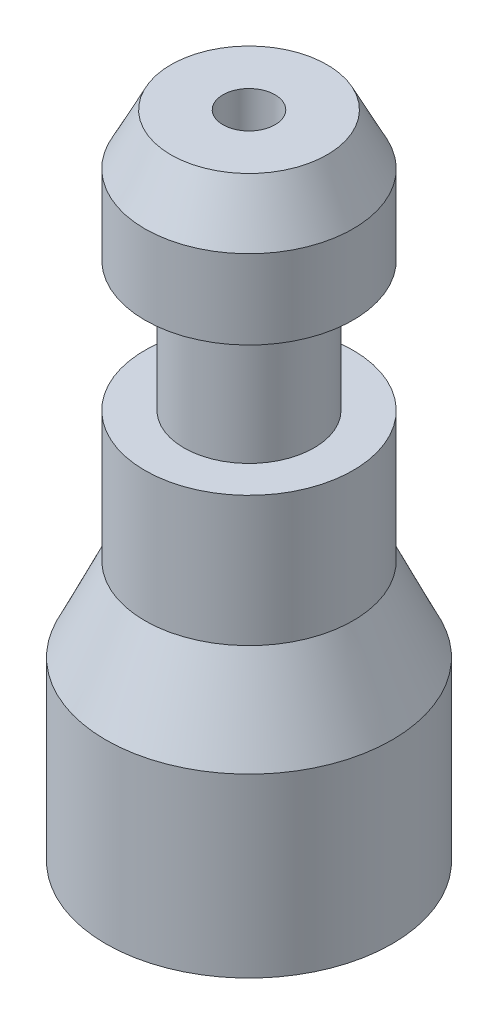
ISO-10303-21;
HEADER;
FILE_DESCRIPTION(('STEP AP214'),'2;1');
FILE_NAME('part.step','',(''),(''),'','','');
FILE_SCHEMA(('AUTOMOTIVE_DESIGN { 1 0 10303 214 1 1 1 1 }'));
ENDSEC;
DATA;
#1=APPLICATION_CONTEXT('core data for automotive mechanical design processes');
#2=APPLICATION_PROTOCOL_DEFINITION('international standard','automotive_design',2000,#1);
#3=PRODUCT_CONTEXT('',#1,'mechanical');
#4=PRODUCT('Part','Part','',(#3));
#5=PRODUCT_RELATED_PRODUCT_CATEGORY('part','',(#4));
#6=PRODUCT_DEFINITION_FORMATION('','',#4);
#7=PRODUCT_DEFINITION_CONTEXT('part definition',#1,'design');
#8=PRODUCT_DEFINITION('design','',#6,#7);
#9=PRODUCT_DEFINITION_SHAPE('','',#8);
#10=(LENGTH_UNIT() NAMED_UNIT(*) SI_UNIT(.MILLI.,.METRE.));
#11=(NAMED_UNIT(*) PLANE_ANGLE_UNIT() SI_UNIT($,.RADIAN.));
#12=(NAMED_UNIT(*) SI_UNIT($,.STERADIAN.) SOLID_ANGLE_UNIT());
#13=UNCERTAINTY_MEASURE_WITH_UNIT(LENGTH_MEASURE(1.E-05),#10,'distance_accuracy_value','');
#14=(GEOMETRIC_REPRESENTATION_CONTEXT(3) GLOBAL_UNCERTAINTY_ASSIGNED_CONTEXT((#13)) GLOBAL_UNIT_ASSIGNED_CONTEXT((#10,
#11,#12)) REPRESENTATION_CONTEXT('',''));
#15=CARTESIAN_POINT('',(0.,0.,0.));
#16=DIRECTION('',(0.,0.,1.));
#17=DIRECTION('',(1.,0.,0.));
#18=AXIS2_PLACEMENT_3D('',#15,#16,#17);
#19=CARTESIAN_POINT('',(0.,0.,0.));
#20=DIRECTION('',(0.,1.,0.));
#21=DIRECTION('',(0.,0.,1.));
#22=AXIS2_PLACEMENT_3D('',#19,#20,#21);
#23=PLANE('',#22);
#24=CARTESIAN_POINT('',(0.,0.,0.));
#25=DIRECTION('',(0.,1.,0.));
#26=DIRECTION('',(0.,0.,1.));
#27=AXIS2_PLACEMENT_3D('',#24,#25,#26);
#28=CIRCLE('',#27,11.);
#29=CARTESIAN_POINT('',(0.,0.,11.));
#30=VERTEX_POINT('',#29);
#31=EDGE_CURVE('E10',#30,#30,#28,.T.);
#32=ORIENTED_EDGE('',*,*,#31,.F.);
#33=EDGE_LOOP('',(#32));
#34=FACE_BOUND('',#33,.T.);
#35=ADVANCED_FACE('F34',(#34),#23,.F.);
#36=CARTESIAN_POINT('',(0.,5.82000000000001,0.));
#37=DIRECTION('',(0.,1.,0.));
#38=DIRECTION('',(0.,0.,1.));
#39=AXIS2_PLACEMENT_3D('',#36,#37,#38);
#40=CYLINDRICAL_SURFACE('',#39,11.);
#41=CARTESIAN_POINT('',(0.,13.57,0.));
#42=DIRECTION('',(0.,1.,0.));
#43=DIRECTION('',(0.,0.,1.));
#44=AXIS2_PLACEMENT_3D('',#41,#42,#43);
#45=CIRCLE('',#44,11.);
#46=CARTESIAN_POINT('',(0.,13.57,11.));
#47=VERTEX_POINT('',#46);
#48=EDGE_CURVE('E40',#47,#47,#45,.T.);
#49=ORIENTED_EDGE('',*,*,#48,.F.);
#50=EDGE_LOOP('',(#49));
#51=FACE_BOUND('',#50,.T.);
#52=ORIENTED_EDGE('',*,*,#31,.T.);
#53=EDGE_LOOP('',(#52));
#54=FACE_BOUND('',#53,.T.);
#55=ADVANCED_FACE('F127',(#51,#54),#40,.T.);
#56=CARTESIAN_POINT('',(0.,13.57,0.));
#57=DIRECTION('',(0.,-1.,0.));
#58=DIRECTION('',(0.,0.,-1.));
#59=AXIS2_PLACEMENT_3D('',#56,#57,#58);
#60=CONICAL_SURFACE('',#59,11.,0.436542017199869);
#61=CARTESIAN_POINT('',(0.,20.,0.));
#62=DIRECTION('',(0.,1.,0.));
#63=DIRECTION('',(0.,0.,1.));
#64=AXIS2_PLACEMENT_3D('',#61,#62,#63);
#65=CIRCLE('',#64,8.);
#66=CARTESIAN_POINT('',(0.,20.,8.));
#67=VERTEX_POINT('',#66);
#68=EDGE_CURVE('E44',#67,#67,#65,.T.);
#69=ORIENTED_EDGE('',*,*,#68,.F.);
#70=EDGE_LOOP('',(#69));
#71=FACE_BOUND('',#70,.T.);
#72=ORIENTED_EDGE('',*,*,#48,.T.);
#73=EDGE_LOOP('',(#72));
#74=FACE_BOUND('',#73,.T.);
#75=ADVANCED_FACE('F122',(#71,#74),#60,.T.);
#76=CARTESIAN_POINT('',(0.,5.82000000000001,0.));
#77=DIRECTION('',(0.,1.,0.));
#78=DIRECTION('',(0.,0.,1.));
#79=AXIS2_PLACEMENT_3D('',#76,#77,#78);
#80=CYLINDRICAL_SURFACE('',#79,8.);
#81=CARTESIAN_POINT('',(0.,30.,0.));
#82=DIRECTION('',(0.,1.,0.));
#83=DIRECTION('',(0.,0.,1.));
#84=AXIS2_PLACEMENT_3D('',#81,#82,#83);
#85=CIRCLE('',#84,8.);
#86=CARTESIAN_POINT('',(0.,30.,8.));
#87=VERTEX_POINT('',#86);
#88=EDGE_CURVE('E48',#87,#87,#85,.T.);
#89=ORIENTED_EDGE('',*,*,#88,.F.);
#90=EDGE_LOOP('',(#89));
#91=FACE_BOUND('',#90,.T.);
#92=ORIENTED_EDGE('',*,*,#68,.T.);
#93=EDGE_LOOP('',(#92));
#94=FACE_BOUND('',#93,.T.);
#95=ADVANCED_FACE('F116',(#91,#94),#80,.T.);
#96=CARTESIAN_POINT('',(0.,30.,-8.));
#97=DIRECTION('',(0.,-1.,0.));
#98=DIRECTION('',(0.,0.,-1.));
#99=AXIS2_PLACEMENT_3D('',#96,#97,#98);
#100=PLANE('',#99);
#101=CARTESIAN_POINT('',(0.,30.,0.));
#102=DIRECTION('',(0.,1.,0.));
#103=DIRECTION('',(0.,0.,1.));
#104=AXIS2_PLACEMENT_3D('',#101,#102,#103);
#105=CIRCLE('',#104,5.);
#106=CARTESIAN_POINT('',(0.,30.,5.));
#107=VERTEX_POINT('',#106);
#108=EDGE_CURVE('E53',#107,#107,#105,.T.);
#109=ORIENTED_EDGE('',*,*,#108,.F.);
#110=EDGE_LOOP('',(#109));
#111=FACE_BOUND('',#110,.T.);
#112=ORIENTED_EDGE('',*,*,#88,.T.);
#113=EDGE_LOOP('',(#112));
#114=FACE_BOUND('',#113,.T.);
#115=ADVANCED_FACE('F110',(#111,#114),#100,.F.);
#116=CARTESIAN_POINT('',(0.,5.82000000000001,0.));
#117=DIRECTION('',(0.,1.,0.));
#118=DIRECTION('',(0.,0.,1.));
#119=AXIS2_PLACEMENT_3D('',#116,#117,#118);
#120=CYLINDRICAL_SURFACE('',#119,5.);
#121=CARTESIAN_POINT('',(0.,40.,0.));
#122=DIRECTION('',(0.,1.,0.));
#123=DIRECTION('',(0.,0.,1.));
#124=AXIS2_PLACEMENT_3D('',#121,#122,#123);
#125=CIRCLE('',#124,5.);
#126=CARTESIAN_POINT('',(0.,40.,5.));
#127=VERTEX_POINT('',#126);
#128=EDGE_CURVE('E56',#127,#127,#125,.T.);
#129=ORIENTED_EDGE('',*,*,#128,.F.);
#130=EDGE_LOOP('',(#129));
#131=FACE_BOUND('',#130,.T.);
#132=ORIENTED_EDGE('',*,*,#108,.T.);
#133=EDGE_LOOP('',(#132));
#134=FACE_BOUND('',#133,.T.);
#135=ADVANCED_FACE('F104',(#131,#134),#120,.T.);
#136=CARTESIAN_POINT('',(0.,40.,-5.));
#137=DIRECTION('',(0.,1.,0.));
#138=DIRECTION('',(0.,0.,1.));
#139=AXIS2_PLACEMENT_3D('',#136,#137,#138);
#140=PLANE('',#139);
#141=CARTESIAN_POINT('',(0.,40.,0.));
#142=DIRECTION('',(0.,1.,0.));
#143=DIRECTION('',(0.,0.,1.));
#144=AXIS2_PLACEMENT_3D('',#141,#142,#143);
#145=CIRCLE('',#144,8.);
#146=CARTESIAN_POINT('',(0.,40.,8.));
#147=VERTEX_POINT('',#146);
#148=EDGE_CURVE('E59',#147,#147,#145,.T.);
#149=ORIENTED_EDGE('',*,*,#148,.F.);
#150=EDGE_LOOP('',(#149));
#151=FACE_BOUND('',#150,.T.);
#152=ORIENTED_EDGE('',*,*,#128,.T.);
#153=EDGE_LOOP('',(#152));
#154=FACE_BOUND('',#153,.T.);
#155=ADVANCED_FACE('F98',(#151,#154),#140,.F.);
#156=CARTESIAN_POINT('',(0.,5.82000000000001,0.));
#157=DIRECTION('',(0.,1.,0.));
#158=DIRECTION('',(0.,0.,1.));
#159=AXIS2_PLACEMENT_3D('',#156,#157,#158);
#160=CYLINDRICAL_SURFACE('',#159,8.);
#161=CARTESIAN_POINT('',(0.,46.0756071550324,0.));
#162=DIRECTION('',(0.,1.,0.));
#163=DIRECTION('',(0.,0.,1.));
#164=AXIS2_PLACEMENT_3D('',#161,#162,#163);
#165=CIRCLE('',#164,8.);
#166=CARTESIAN_POINT('',(0.,46.0756071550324,8.));
#167=VERTEX_POINT('',#166);
#168=EDGE_CURVE('E62',#167,#167,#165,.T.);
#169=ORIENTED_EDGE('',*,*,#168,.F.);
#170=EDGE_LOOP('',(#169));
#171=FACE_BOUND('',#170,.T.);
#172=ORIENTED_EDGE('',*,*,#148,.T.);
#173=EDGE_LOOP('',(#172));
#174=FACE_BOUND('',#173,.T.);
#175=ADVANCED_FACE('F92',(#171,#174),#160,.T.);
#176=CARTESIAN_POINT('',(0.,46.0756071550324,0.));
#177=DIRECTION('',(0.,-1.,0.));
#178=DIRECTION('',(0.,0.,-1.));
#179=AXIS2_PLACEMENT_3D('',#176,#177,#178);
#180=CONICAL_SURFACE('',#179,8.,0.47132425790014);
#181=CARTESIAN_POINT('',(0.,50.,0.));
#182=DIRECTION('',(0.,1.,0.));
#183=DIRECTION('',(0.,0.,1.));
#184=AXIS2_PLACEMENT_3D('',#181,#182,#183);
#185=CIRCLE('',#184,5.99999999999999);
#186=CARTESIAN_POINT('',(0.,50.,5.99999999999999));
#187=VERTEX_POINT('',#186);
#188=EDGE_CURVE('E65',#187,#187,#185,.T.);
#189=ORIENTED_EDGE('',*,*,#188,.F.);
#190=EDGE_LOOP('',(#189));
#191=FACE_BOUND('',#190,.T.);
#192=ORIENTED_EDGE('',*,*,#168,.T.);
#193=EDGE_LOOP('',(#192));
#194=FACE_BOUND('',#193,.T.);
#195=ADVANCED_FACE('F86',(#191,#194),#180,.T.);
#196=CARTESIAN_POINT('',(0.,50.,-5.99999999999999));
#197=DIRECTION('',(0.,-1.,0.));
#198=DIRECTION('',(0.,0.,-1.));
#199=AXIS2_PLACEMENT_3D('',#196,#197,#198);
#200=PLANE('',#199);
#201=CARTESIAN_POINT('',(0.,50.,0.));
#202=DIRECTION('',(0.,1.,0.));
#203=DIRECTION('',(0.,0.,1.));
#204=AXIS2_PLACEMENT_3D('',#201,#202,#203);
#205=CIRCLE('',#204,1.99999999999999);
#206=CARTESIAN_POINT('',(0.,50.,1.99999999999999));
#207=VERTEX_POINT('',#206);
#208=EDGE_CURVE('E68',#207,#207,#205,.T.);
#209=ORIENTED_EDGE('',*,*,#208,.F.);
#210=EDGE_LOOP('',(#209));
#211=FACE_BOUND('',#210,.T.);
#212=ORIENTED_EDGE('',*,*,#188,.T.);
#213=EDGE_LOOP('',(#212));
#214=FACE_BOUND('',#213,.T.);
#215=ADVANCED_FACE('F80',(#211,#214),#200,.F.);
#216=CARTESIAN_POINT('',(0.,5.82000000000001,0.));
#217=DIRECTION('',(0.,1.,0.));
#218=DIRECTION('',(0.,0.,1.));
#219=AXIS2_PLACEMENT_3D('',#216,#217,#218);
#220=CYLINDRICAL_SURFACE('',#219,2.);
#221=CARTESIAN_POINT('',(0.,5.82000000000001,0.));
#222=DIRECTION('',(0.,1.,0.));
#223=DIRECTION('',(0.,0.,1.));
#224=AXIS2_PLACEMENT_3D('',#221,#222,#223);
#225=CIRCLE('',#224,2.);
#226=CARTESIAN_POINT('',(0.,5.82000000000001,2.));
#227=VERTEX_POINT('',#226);
#228=EDGE_CURVE('E71',#227,#227,#225,.T.);
#229=ORIENTED_EDGE('',*,*,#228,.F.);
#230=EDGE_LOOP('',(#229));
#231=FACE_BOUND('',#230,.T.);
#232=ORIENTED_EDGE('',*,*,#208,.T.);
#233=EDGE_LOOP('',(#232));
#234=FACE_BOUND('',#233,.T.);
#235=ADVANCED_FACE('F77',(#231,#234),#220,.F.);
#236=CARTESIAN_POINT('',(0.,5.82000000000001,-2.));
#237=DIRECTION('',(0.,-1.,0.));
#238=DIRECTION('',(0.,0.,-1.));
#239=AXIS2_PLACEMENT_3D('',#236,#237,#238);
#240=PLANE('',#239);
#241=ORIENTED_EDGE('',*,*,#228,.T.);
#242=EDGE_LOOP('',(#241));
#243=FACE_BOUND('',#242,.T.);
#244=ADVANCED_FACE('F75',(#243),#240,.F.);
#245=CLOSED_SHELL('',(#35,#55,#75,#95,#115,#135,#155,#175,#195,#215,#235,#244));
#246=MANIFOLD_SOLID_BREP('B2',#245);
#247=ADVANCED_BREP_SHAPE_REPRESENTATION('',(#18,#246),#14);
#248=SHAPE_DEFINITION_REPRESENTATION(#9,#247);
ENDSEC;
END-ISO-10303-21;
